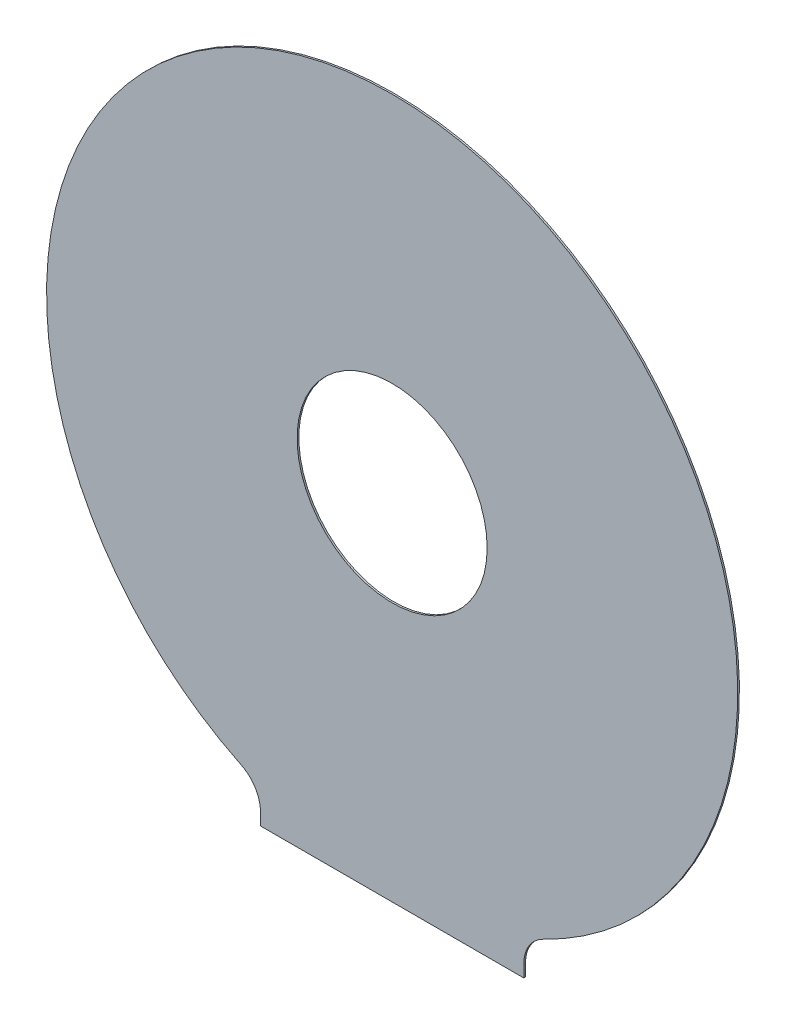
ISO-10303-21;
HEADER;
FILE_DESCRIPTION(('STEP AP214'),'2;1');
FILE_NAME('part.step','',(''),(''),'','','');
FILE_SCHEMA(('AUTOMOTIVE_DESIGN { 1 0 10303 214 1 1 1 1 }'));
ENDSEC;
DATA;
#1=APPLICATION_CONTEXT('core data for automotive mechanical design processes');
#2=APPLICATION_PROTOCOL_DEFINITION('international standard','automotive_design',2000,#1);
#3=PRODUCT_CONTEXT('',#1,'mechanical');
#4=PRODUCT('Part','Part','',(#3));
#5=PRODUCT_RELATED_PRODUCT_CATEGORY('part','',(#4));
#6=PRODUCT_DEFINITION_FORMATION('','',#4);
#7=PRODUCT_DEFINITION_CONTEXT('part definition',#1,'design');
#8=PRODUCT_DEFINITION('design','',#6,#7);
#9=PRODUCT_DEFINITION_SHAPE('','',#8);
#10=(LENGTH_UNIT() NAMED_UNIT(*) SI_UNIT(.MILLI.,.METRE.));
#11=(NAMED_UNIT(*) PLANE_ANGLE_UNIT() SI_UNIT($,.RADIAN.));
#12=(NAMED_UNIT(*) SI_UNIT($,.STERADIAN.) SOLID_ANGLE_UNIT());
#13=UNCERTAINTY_MEASURE_WITH_UNIT(LENGTH_MEASURE(1.E-05),#10,'distance_accuracy_value','');
#14=(GEOMETRIC_REPRESENTATION_CONTEXT(3) GLOBAL_UNCERTAINTY_ASSIGNED_CONTEXT((#13)) GLOBAL_UNIT_ASSIGNED_CONTEXT((#10,
#11,#12)) REPRESENTATION_CONTEXT('',''));
#15=CARTESIAN_POINT('',(0.,0.,0.));
#16=DIRECTION('',(0.,0.,1.));
#17=DIRECTION('',(1.,0.,0.));
#18=AXIS2_PLACEMENT_3D('',#15,#16,#17);
#19=CARTESIAN_POINT('',(4.81000000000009,-9.89261846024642,0.05));
#20=DIRECTION('',(0.,0.,1.));
#21=DIRECTION('',(1.,0.,0.));
#22=AXIS2_PLACEMENT_3D('',#19,#20,#21);
#23=PLANE('',#22);
#24=DIRECTION('',(1.,0.,0.));
#25=VECTOR('',#24,1.);
#26=CARTESIAN_POINT('',(-3.80999999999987,-10.2457503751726,0.05));
#27=LINE('',#26,#25);
#28=CARTESIAN_POINT('',(-3.80999999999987,-10.2457503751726,0.05));
#29=VERTEX_POINT('',#28);
#30=CARTESIAN_POINT('',(3.80999999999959,-10.2457503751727,0.05));
#31=VERTEX_POINT('',#30);
#32=EDGE_CURVE('E145',#29,#31,#27,.T.);
#33=ORIENTED_EDGE('',*,*,#32,.T.);
#34=DIRECTION('',(3.14393284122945E-13,1.,0.));
#35=VECTOR('',#34,1.);
#36=CARTESIAN_POINT('',(3.80999999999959,-10.2457503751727,0.05));
#37=LINE('',#36,#35);
#38=CARTESIAN_POINT('',(3.8099999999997,-9.89261846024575,0.05));
#39=VERTEX_POINT('',#38);
#40=EDGE_CURVE('E93',#31,#39,#37,.T.);
#41=ORIENTED_EDGE('',*,*,#40,.T.);
#42=CARTESIAN_POINT('',(4.81000000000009,-9.89261846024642,0.05));
#43=DIRECTION('',(0.,0.,-1.));
#44=DIRECTION('',(1.,0.,0.));
#45=AXIS2_PLACEMENT_3D('',#42,#43,#44);
#46=CIRCLE('',#45,1.00000000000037);
#47=CARTESIAN_POINT('',(4.37272727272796,-8.99328950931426,0.05));
#48=VERTEX_POINT('',#47);
#49=EDGE_CURVE('E106',#39,#48,#46,.T.);
#50=ORIENTED_EDGE('',*,*,#49,.T.);
#51=CARTESIAN_POINT('',(0.,0.,0.05));
#52=DIRECTION('',(0.,0.,1.));
#53=DIRECTION('',(1.,0.,0.));
#54=AXIS2_PLACEMENT_3D('',#51,#52,#53);
#55=CIRCLE('',#54,10.0000000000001);
#56=CARTESIAN_POINT('',(-4.37272727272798,-8.99328950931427,0.05));
#57=VERTEX_POINT('',#56);
#58=EDGE_CURVE('E100',#48,#57,#55,.T.);
#59=ORIENTED_EDGE('',*,*,#58,.T.);
#60=CARTESIAN_POINT('',(-4.81000000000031,-9.89261846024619,0.05));
#61=DIRECTION('',(0.,0.,-1.));
#62=DIRECTION('',(1.,0.,0.));
#63=AXIS2_PLACEMENT_3D('',#60,#61,#62);
#64=CIRCLE('',#63,1.00000000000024);
#65=CARTESIAN_POINT('',(-3.81000000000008,-9.89261846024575,0.05));
#66=VERTEX_POINT('',#65);
#67=EDGE_CURVE('E104',#57,#66,#64,.T.);
#68=ORIENTED_EDGE('',*,*,#67,.T.);
#69=DIRECTION('',(6.28786568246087E-13,-1.,0.));
#70=VECTOR('',#69,1.);
#71=CARTESIAN_POINT('',(-3.81000000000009,-9.89261846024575,0.05));
#72=LINE('',#71,#70);
#73=EDGE_CURVE('E56',#66,#29,#72,.T.);
#74=ORIENTED_EDGE('',*,*,#73,.T.);
#75=EDGE_LOOP('',(#33,#41,#50,#59,#68,#74));
#76=FACE_BOUND('',#75,.T.);
#77=CARTESIAN_POINT('',(0.,0.,0.05));
#78=DIRECTION('',(0.,0.,1.));
#79=DIRECTION('',(1.,0.,0.));
#80=AXIS2_PLACEMENT_3D('',#77,#78,#79);
#81=CIRCLE('',#80,2.75000000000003);
#82=CARTESIAN_POINT('',(2.75000000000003,0.,0.05));
#83=VERTEX_POINT('',#82);
#84=EDGE_CURVE('E133',#83,#83,#81,.T.);
#85=ORIENTED_EDGE('',*,*,#84,.F.);
#86=EDGE_LOOP('',(#85));
#87=FACE_BOUND('',#86,.T.);
#88=ADVANCED_FACE('F38',(#76,#87),#23,.T.);
#89=CARTESIAN_POINT('',(4.81000000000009,-9.89261846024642,0.));
#90=DIRECTION('',(0.,0.,1.));
#91=DIRECTION('',(1.,0.,0.));
#92=AXIS2_PLACEMENT_3D('',#89,#90,#91);
#93=PLANE('',#92);
#94=DIRECTION('',(1.,0.,0.));
#95=VECTOR('',#94,1.);
#96=CARTESIAN_POINT('',(-3.80999999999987,-10.2457503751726,0.));
#97=LINE('',#96,#95);
#98=CARTESIAN_POINT('',(-3.80999999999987,-10.2457503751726,0.));
#99=VERTEX_POINT('',#98);
#100=CARTESIAN_POINT('',(3.80999999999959,-10.2457503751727,0.));
#101=VERTEX_POINT('',#100);
#102=EDGE_CURVE('E128',#99,#101,#97,.T.);
#103=ORIENTED_EDGE('',*,*,#102,.F.);
#104=DIRECTION('',(6.28786568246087E-13,-1.,0.));
#105=VECTOR('',#104,1.);
#106=CARTESIAN_POINT('',(-3.81000000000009,-9.89261846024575,0.));
#107=LINE('',#106,#105);
#108=CARTESIAN_POINT('',(-3.81000000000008,-9.89261846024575,0.));
#109=VERTEX_POINT('',#108);
#110=EDGE_CURVE('E85',#109,#99,#107,.T.);
#111=ORIENTED_EDGE('',*,*,#110,.F.);
#112=CARTESIAN_POINT('',(-4.81000000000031,-9.89261846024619,0.));
#113=DIRECTION('',(0.,0.,-1.));
#114=DIRECTION('',(1.,0.,0.));
#115=AXIS2_PLACEMENT_3D('',#112,#113,#114);
#116=CIRCLE('',#115,1.00000000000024);
#117=CARTESIAN_POINT('',(-4.37272727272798,-8.99328950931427,0.));
#118=VERTEX_POINT('',#117);
#119=EDGE_CURVE('E79',#118,#109,#116,.T.);
#120=ORIENTED_EDGE('',*,*,#119,.F.);
#121=CARTESIAN_POINT('',(0.,0.,0.));
#122=DIRECTION('',(0.,0.,1.));
#123=DIRECTION('',(1.,0.,0.));
#124=AXIS2_PLACEMENT_3D('',#121,#122,#123);
#125=CIRCLE('',#124,10.0000000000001);
#126=CARTESIAN_POINT('',(4.37272727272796,-8.99328950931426,0.));
#127=VERTEX_POINT('',#126);
#128=EDGE_CURVE('E115',#127,#118,#125,.T.);
#129=ORIENTED_EDGE('',*,*,#128,.F.);
#130=CARTESIAN_POINT('',(4.81000000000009,-9.89261846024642,0.));
#131=DIRECTION('',(0.,0.,-1.));
#132=DIRECTION('',(1.,0.,0.));
#133=AXIS2_PLACEMENT_3D('',#130,#131,#132);
#134=CIRCLE('',#133,1.00000000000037);
#135=CARTESIAN_POINT('',(3.8099999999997,-9.89261846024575,0.));
#136=VERTEX_POINT('',#135);
#137=EDGE_CURVE('E136',#136,#127,#134,.T.);
#138=ORIENTED_EDGE('',*,*,#137,.F.);
#139=DIRECTION('',(3.14393284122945E-13,1.,0.));
#140=VECTOR('',#139,1.);
#141=CARTESIAN_POINT('',(3.80999999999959,-10.2457503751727,0.));
#142=LINE('',#141,#140);
#143=EDGE_CURVE('E132',#101,#136,#142,.T.);
#144=ORIENTED_EDGE('',*,*,#143,.F.);
#145=EDGE_LOOP('',(#103,#111,#120,#129,#138,#144));
#146=FACE_BOUND('',#145,.T.);
#147=CARTESIAN_POINT('',(0.,0.,0.));
#148=DIRECTION('',(0.,0.,1.));
#149=DIRECTION('',(1.,0.,0.));
#150=AXIS2_PLACEMENT_3D('',#147,#148,#149);
#151=CIRCLE('',#150,2.75000000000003);
#152=CARTESIAN_POINT('',(2.75000000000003,0.,0.));
#153=VERTEX_POINT('',#152);
#154=EDGE_CURVE('E251',#153,#153,#151,.T.);
#155=ORIENTED_EDGE('',*,*,#154,.T.);
#156=EDGE_LOOP('',(#155));
#157=FACE_BOUND('',#156,.T.);
#158=ADVANCED_FACE('F158',(#146,#157),#93,.F.);
#159=CARTESIAN_POINT('',(-3.80999999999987,-10.2457503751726,0.05));
#160=DIRECTION('',(0.,1.,0.));
#161=DIRECTION('',(-1.,0.,0.));
#162=AXIS2_PLACEMENT_3D('',#159,#160,#161);
#163=PLANE('',#162);
#164=ORIENTED_EDGE('',*,*,#102,.T.);
#165=DIRECTION('',(0.,0.,-1.));
#166=VECTOR('',#165,1.);
#167=CARTESIAN_POINT('',(3.80999999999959,-10.2457503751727,0.05));
#168=LINE('',#167,#166);
#169=EDGE_CURVE('E11',#31,#101,#168,.T.);
#170=ORIENTED_EDGE('',*,*,#169,.F.);
#171=ORIENTED_EDGE('',*,*,#32,.F.);
#172=DIRECTION('',(0.,0.,-1.));
#173=VECTOR('',#172,1.);
#174=CARTESIAN_POINT('',(-3.80999999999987,-10.2457503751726,0.05));
#175=LINE('',#174,#173);
#176=EDGE_CURVE('E124',#29,#99,#175,.T.);
#177=ORIENTED_EDGE('',*,*,#176,.T.);
#178=EDGE_LOOP('',(#164,#170,#171,#177));
#179=FACE_BOUND('',#178,.T.);
#180=ADVANCED_FACE('F40',(#179),#163,.F.);
#181=CARTESIAN_POINT('',(3.80999999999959,-10.2457503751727,0.05));
#182=DIRECTION('',(-1.,3.14393284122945E-13,0.));
#183=DIRECTION('',(-3.14393284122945E-13,-1.,0.));
#184=AXIS2_PLACEMENT_3D('',#181,#182,#183);
#185=PLANE('',#184);
#186=ORIENTED_EDGE('',*,*,#143,.T.);
#187=DIRECTION('',(0.,0.,-1.));
#188=VECTOR('',#187,1.);
#189=CARTESIAN_POINT('',(3.8099999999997,-9.89261846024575,0.05));
#190=LINE('',#189,#188);
#191=EDGE_CURVE('E48',#39,#136,#190,.T.);
#192=ORIENTED_EDGE('',*,*,#191,.F.);
#193=ORIENTED_EDGE('',*,*,#40,.F.);
#194=ORIENTED_EDGE('',*,*,#169,.T.);
#195=EDGE_LOOP('',(#186,#192,#193,#194));
#196=FACE_BOUND('',#195,.T.);
#197=ADVANCED_FACE('F183',(#196),#185,.F.);
#198=CARTESIAN_POINT('',(4.81000000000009,-9.89261846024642,0.05));
#199=DIRECTION('',(0.,0.,-1.));
#200=DIRECTION('',(-1.,0.,0.));
#201=AXIS2_PLACEMENT_3D('',#198,#199,#200);
#202=CYLINDRICAL_SURFACE('',#201,1.00000000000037);
#203=ORIENTED_EDGE('',*,*,#137,.T.);
#204=DIRECTION('',(0.,0.,-1.));
#205=VECTOR('',#204,1.);
#206=CARTESIAN_POINT('',(4.37272727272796,-8.99328950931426,0.05));
#207=LINE('',#206,#205);
#208=EDGE_CURVE('E117',#48,#127,#207,.T.);
#209=ORIENTED_EDGE('',*,*,#208,.F.);
#210=ORIENTED_EDGE('',*,*,#49,.F.);
#211=ORIENTED_EDGE('',*,*,#191,.T.);
#212=EDGE_LOOP('',(#203,#209,#210,#211));
#213=FACE_BOUND('',#212,.T.);
#214=ADVANCED_FACE('F155',(#213),#202,.F.);
#215=CARTESIAN_POINT('',(0.,0.,0.05));
#216=DIRECTION('',(0.,0.,-1.));
#217=DIRECTION('',(-1.,0.,0.));
#218=AXIS2_PLACEMENT_3D('',#215,#216,#217);
#219=CYLINDRICAL_SURFACE('',#218,10.0000000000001);
#220=ORIENTED_EDGE('',*,*,#128,.T.);
#221=DIRECTION('',(0.,0.,-1.));
#222=VECTOR('',#221,1.);
#223=CARTESIAN_POINT('',(-4.37272727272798,-8.99328950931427,0.05));
#224=LINE('',#223,#222);
#225=EDGE_CURVE('E112',#57,#118,#224,.T.);
#226=ORIENTED_EDGE('',*,*,#225,.F.);
#227=ORIENTED_EDGE('',*,*,#58,.F.);
#228=ORIENTED_EDGE('',*,*,#208,.T.);
#229=EDGE_LOOP('',(#220,#226,#227,#228));
#230=FACE_BOUND('',#229,.T.);
#231=ADVANCED_FACE('F113',(#230),#219,.T.);
#232=CARTESIAN_POINT('',(-4.81000000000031,-9.89261846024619,0.05));
#233=DIRECTION('',(0.,0.,-1.));
#234=DIRECTION('',(-1.,0.,0.));
#235=AXIS2_PLACEMENT_3D('',#232,#233,#234);
#236=CYLINDRICAL_SURFACE('',#235,1.00000000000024);
#237=ORIENTED_EDGE('',*,*,#119,.T.);
#238=DIRECTION('',(0.,0.,-1.));
#239=VECTOR('',#238,1.);
#240=CARTESIAN_POINT('',(-3.81000000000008,-9.89261846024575,0.05));
#241=LINE('',#240,#239);
#242=EDGE_CURVE('E118',#66,#109,#241,.T.);
#243=ORIENTED_EDGE('',*,*,#242,.F.);
#244=ORIENTED_EDGE('',*,*,#67,.F.);
#245=ORIENTED_EDGE('',*,*,#225,.T.);
#246=EDGE_LOOP('',(#237,#243,#244,#245));
#247=FACE_BOUND('',#246,.T.);
#248=ADVANCED_FACE('F120',(#247),#236,.F.);
#249=CARTESIAN_POINT('',(-3.81000000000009,-9.89261846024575,0.05));
#250=DIRECTION('',(1.,6.28786568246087E-13,0.));
#251=DIRECTION('',(-6.28786568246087E-13,1.,0.));
#252=AXIS2_PLACEMENT_3D('',#249,#250,#251);
#253=PLANE('',#252);
#254=ORIENTED_EDGE('',*,*,#110,.T.);
#255=ORIENTED_EDGE('',*,*,#176,.F.);
#256=ORIENTED_EDGE('',*,*,#73,.F.);
#257=ORIENTED_EDGE('',*,*,#242,.T.);
#258=EDGE_LOOP('',(#254,#255,#256,#257));
#259=FACE_BOUND('',#258,.T.);
#260=ADVANCED_FACE('F163',(#259),#253,.F.);
#261=CARTESIAN_POINT('',(0.,0.,0.05));
#262=DIRECTION('',(0.,0.,-1.));
#263=DIRECTION('',(-1.,0.,0.));
#264=AXIS2_PLACEMENT_3D('',#261,#262,#263);
#265=CYLINDRICAL_SURFACE('',#264,2.75000000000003);
#266=ORIENTED_EDGE('',*,*,#84,.T.);
#267=EDGE_LOOP('',(#266));
#268=FACE_BOUND('',#267,.T.);
#269=ORIENTED_EDGE('',*,*,#154,.F.);
#270=EDGE_LOOP('',(#269));
#271=FACE_BOUND('',#270,.T.);
#272=ADVANCED_FACE('F165',(#268,#271),#265,.F.);
#273=CLOSED_SHELL('',(#88,#158,#180,#197,#214,#231,#248,#260,#272));
#274=MANIFOLD_SOLID_BREP('B2',#273);
#275=ADVANCED_BREP_SHAPE_REPRESENTATION('',(#18,#274),#14);
#276=SHAPE_DEFINITION_REPRESENTATION(#9,#275);
ENDSEC;
END-ISO-10303-21;
